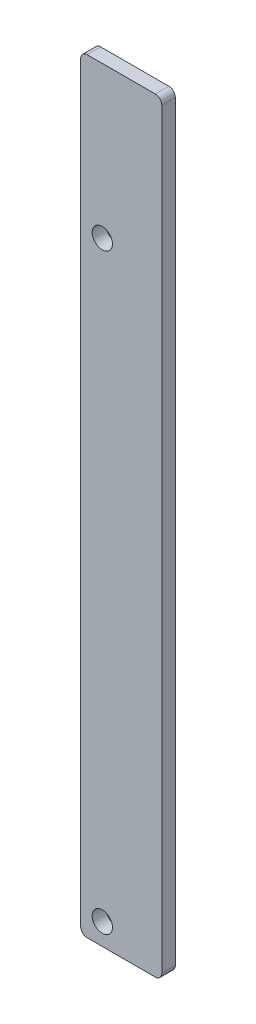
from build123d import *

# Parameters (mm, degrees)
BOSS_EXTRUDE1_DEPTH = 3.175
HOLE1_D             = 4.7625


with BuildPart() as part:
    # Sketch1 → Boss-Extrude1 (new body)
    with BuildSketch(Plane.XY):
        with BuildLine():
            Line((-1200.2062135, -20.32), (-1216.2082135, -20.32))
            ThreePointArc((-1216.2082135, -20.32), (-1217.285844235, -20.766369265), (-1217.7322135, -21.844))
            Line((-1217.7322135, -21.844), (-1217.7322135, -198.501))
            ThreePointArc((-1217.7322135, -198.501), (-1217.285844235, -199.578630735), (-1216.2082135, -200.025))
            Line((-1216.2082135, -200.025), (-1200.2062135, -200.025))
            ThreePointArc((-1200.2062135, -200.025), (-1199.128582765, -199.578630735), (-1198.6822135, -198.501))
            Line((-1198.6822135, -198.501), (-1198.6822135, -21.844))
            ThreePointArc((-1198.6822135, -21.844), (-1199.128582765, -20.766369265), (-1200.2062135, -20.32))
        make_face()
    extrude(amount=BOSS_EXTRUDE1_DEPTH)

    # Hole1 (through all)
    with Locations(Plane(origin=(-1216.306474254, -45.278859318, 3.175), x_dir=(1, 0, 0), z_dir=(0, 0, 1))):
        with Locations((3.654260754, -10.601140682), (3.654260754, -149.666140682)):
            Hole(HOLE1_D / 2)


solid = part.part
